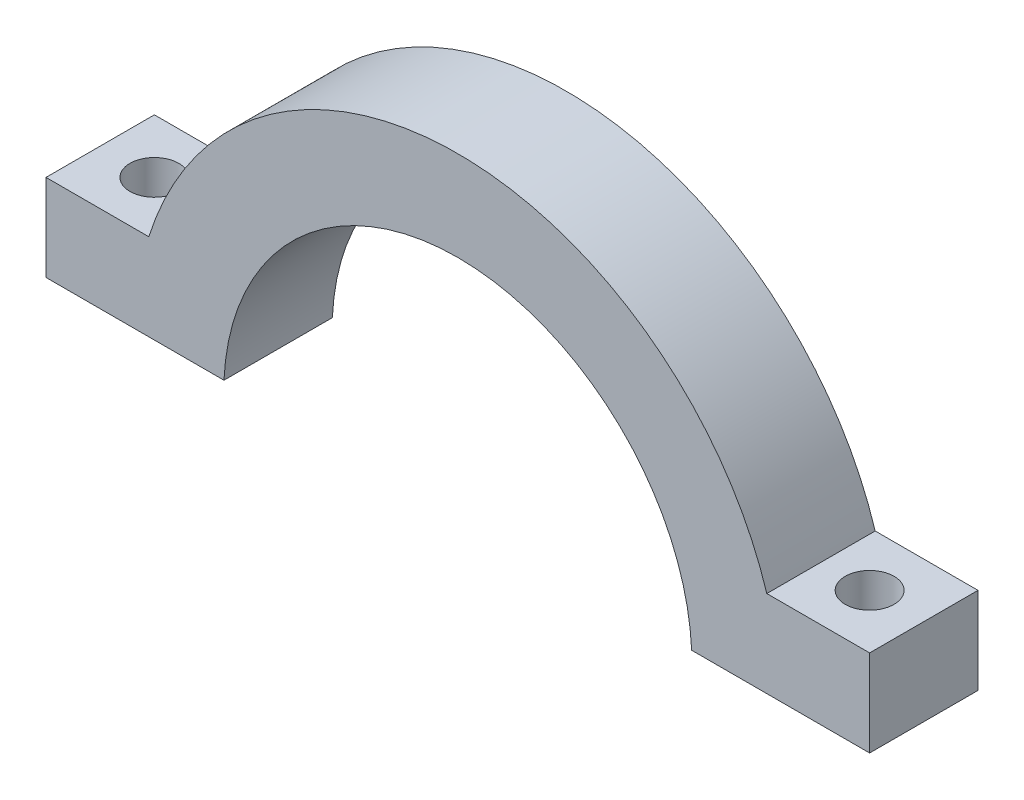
from build123d import *

# Parameters (mm, degrees)
EXTRUDE1_DEPTH     = 63.5
SKETCH2_R          = 14.2875
CUT_EXTRUDE1_DEPTH = 50.8


with BuildPart() as part:
    # Sketch1 → Extrude1 (new body)
    with BuildSketch(Plane.XY):
        with BuildLine():
            Line((-241.3, 6.35), (-137.012930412, 6.35))
            ThreePointArc((-137.012930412, 6.35), (0, 137.16), (137.012930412, 6.35))
            Line((137.012930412, 6.35), (241.3, 6.35))
            Line((241.3, 6.35), (241.3, 57.15))
            Line((241.3, 57.15), (181.059646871, 57.15))
            ThreePointArc((181.059646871, 57.15), (0, 189.865), (-181.059646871, 57.15))
            Line((-181.059646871, 57.15), (-241.3, 57.15))
            Line((-241.3, 57.15), (-241.3, 6.35))
        make_face()
    extrude(amount=EXTRUDE1_DEPTH)

    # Sketch2 → Cut-Extrude1 (cut)
    with BuildSketch(Plane(origin=(0, 57.15, 0), x_dir=(-1, 0, 0), z_dir=(0, 1, 0))):
        with Locations(Location((209.55, 31.75, 0), (0, 0, 90))):
            Circle(SKETCH2_R)
        with Locations(Location((-209.55, 31.75, 0), (0, 0, 90))):
            Circle(SKETCH2_R)
    extrude(amount=-CUT_EXTRUDE1_DEPTH, mode=Mode.SUBTRACT)


solid = part.part
